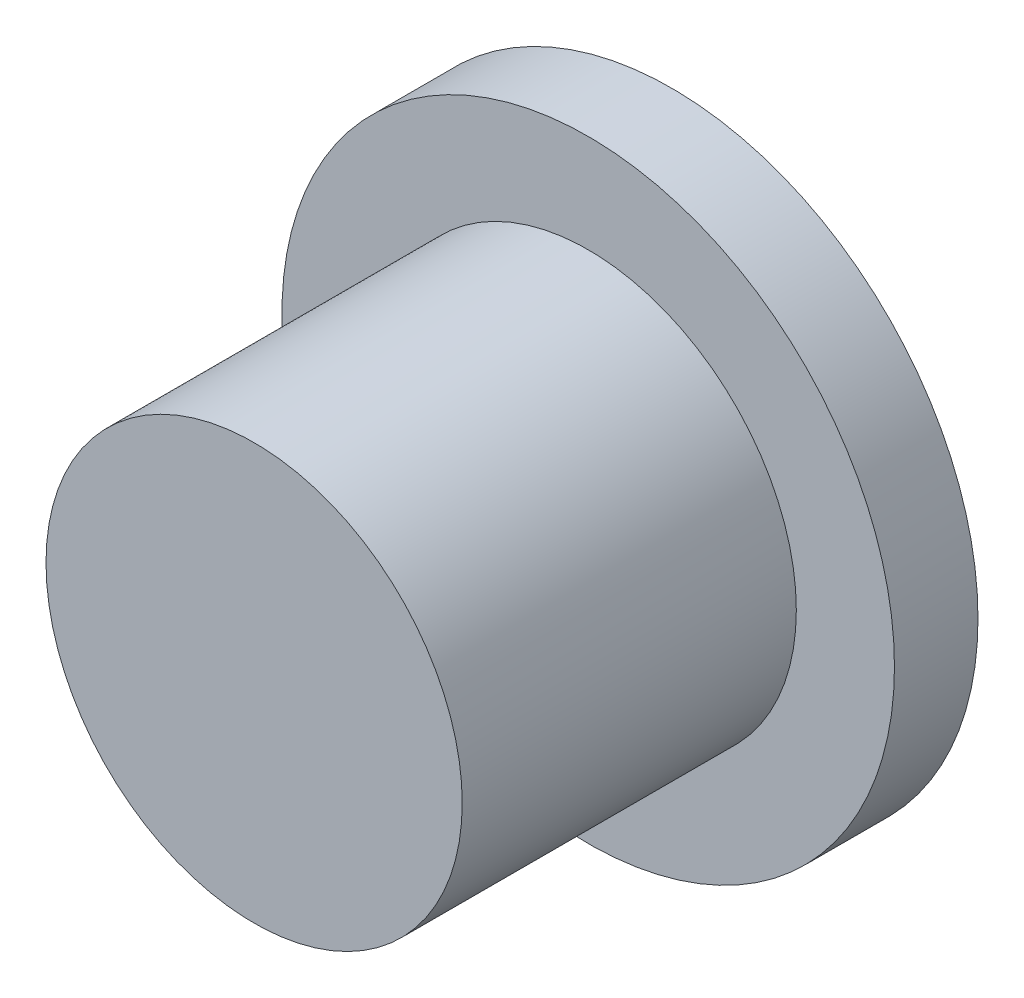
from build123d import *

# Parameters (mm, degrees)
SCHNITT_LINEAR_AUSTRAGEN1_DEPTH = 7.5


with BuildPart() as part:
    # Skizze6 → Basis-Rotation (revolve)
    with BuildSketch(Plane(origin=(0, 0, 0), x_dir=(0, 0, -1), z_dir=(1, 0, 0)), mode=Mode.PRIVATE) as basis_rotation_sk:
        Polygon((-12, 7.475), (0, 7.475), (0, 11), (3, 11), (3, 0), (-12, 0), align=None)
    revolve(basis_rotation_sk.sketch.rotate(Axis((0, 0, 65.723959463), (0, 0, -1)), 90), axis=Axis((0, 0, 65.723959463), (0, 0, -1)))

    # Skizze7 → Schnitt-Linear austragen1 (cut)
    with BuildSketch(Plane.XY.offset(-3)):
        Polygon((0, 4.618802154), (-4, 2.309401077), (-4, -2.309401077), (0, -4.618802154), (4, -2.309401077), (4, 2.309401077), align=None)
    extrude(amount=SCHNITT_LINEAR_AUSTRAGEN1_DEPTH, mode=Mode.SUBTRACT)


solid = part.part
